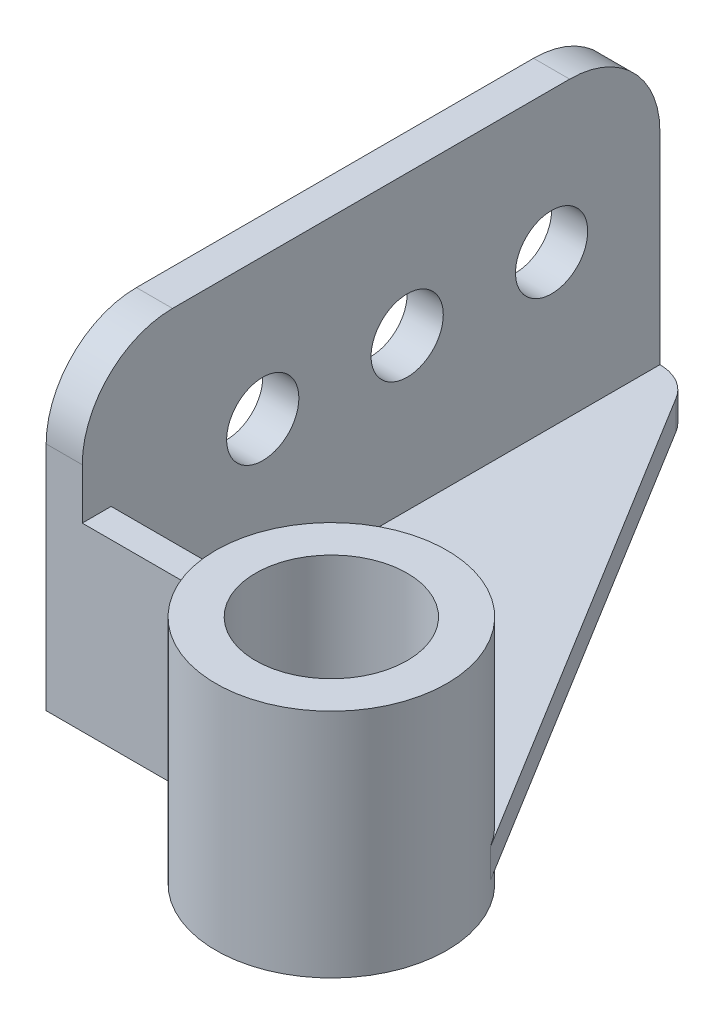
from build123d import *

# Parameters (mm, degrees)
BASE_EXTRUDE_DEPTH       = 10
BOSS_EXTRUDE1_DEPTH      = 8
SKETCH3_R                = 32
BOSS_EXTRUDE2_DEPTH      = 64
SKETCH7_R                = 21
CUT_EXTRUDE1_DEPTH       = 237.258333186
BOSS_EXTRUDE3_REACH      = 233.901
BOSS_EXTRUDE3_END_RADIUS = 32
SKETCH4_W                = 8
SKETCH4_H                = 42
HOLE1_D                  = 20
LPATTERN1_COUNT          = 3
LPATTERN1_PITCH          = 40


with BuildPart() as part:
    # Sketch1 → Base-Extrude (new body)
    with BuildSketch(Plane(origin=(0, 0, 0), x_dir=(0, 0, 1), z_dir=(1, 0, 0))):
        with BuildLine():
            Line((25, 0), (135, 0))
            ThreePointArc((135, 0), (152.67766953, 7.32233047), (160, 25))
            Line((160, 25), (160, 89))
            Line((160, 89), (0, 89))
            Line((0, 89), (0, 25))
            ThreePointArc((0, 25), (7.32233047, 7.32233047), (25, 0))
        make_face()
    extrude(amount=BASE_EXTRUDE_DEPTH)

    # Sketch2 → Boss-Extrude1 (add)
    with BuildSketch(Plane(origin=(0, -89, 0), x_dir=(-1, 0, 0), z_dir=(0, -1, 0))):
        with BuildLine():
            Line((-10, -160), (-10, 0))
            ThreePointArc((-10, 0), (-15.857381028, -1.526648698), (-20.224401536, -5.718152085))
            Line((-20.224401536, -5.718152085), (-102.265070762, -139.248405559))
            ThreePointArc((-102.265070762, -139.248405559), (-85.615253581, -186.188017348), (-43.250984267, -160))
            Line((-43.250984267, -160), (-10, -160))
        make_face()
    extrude(amount=-BOSS_EXTRUDE1_DEPTH)

    # Sketch3 → Boss-Extrude2 (add)
    with BuildSketch(Plane(origin=(0, -95, 0), x_dir=(-1, 0, 0), z_dir=(0, -1, 0))):
        with Locations(Location((-75, -156, 0), (0, 0, 180))):
            Circle(SKETCH3_R)
    extrude(amount=-BOSS_EXTRUDE2_DEPTH)

    # Sketch7 → Cut-Extrude1 (cut, through all)
    with BuildSketch(Plane(origin=(0, -95, 0), x_dir=(-1, 0, 0), z_dir=(0, -1, 0))):
        with Locations(Location((-75, -156, 0), (0, 0, 180))):
            Circle(SKETCH7_R)
    extrude(amount=-CUT_EXTRUDE1_DEPTH, mode=Mode.SUBTRACT)

    # Boss-Extrude3: up to this cylinder (the profile starts outside it)
    boss_extrude3_end = Plane(origin=(75, -60, 156), z_dir=(0, -1, 0)) * Cylinder(BOSS_EXTRUDE3_END_RADIUS, 532.802, mode=Mode.PRIVATE)
    # Sketch4 → Boss-Extrude3 (add, up to the surface)
    with BuildSketch(Plane(origin=(10, 0, 0), x_dir=(0, 0, -1), z_dir=(1, 0, 0)), mode=Mode.PRIVATE) as boss_extrude3_sk1:
        with Locations((-156, -60)):
            Rectangle(SKETCH4_W, SKETCH4_H)
    boss_extrude3_tool1 = extrude(boss_extrude3_sk1.sketch, amount=BOSS_EXTRUDE3_REACH, mode=Mode.PRIVATE) - boss_extrude3_end
    add(boss_extrude3_tool1.solids().sort_by_distance((10, -60, 156))[0])

    # Hole1 (through all)
    with Locations(Plane(origin=(10, 0, 0), x_dir=(0, 0, -1), z_dir=(1, 0, 0))):
        with Locations((-30, -39)):
            hole1 = Hole(HOLE1_D / 2)

    # LPattern1: Hole1 ×3
    with Locations(*[(0, 0, i * LPATTERN1_PITCH) for i in range(1, LPATTERN1_COUNT)]):
        add(hole1, mode=Mode.SUBTRACT)


solid = part.part
